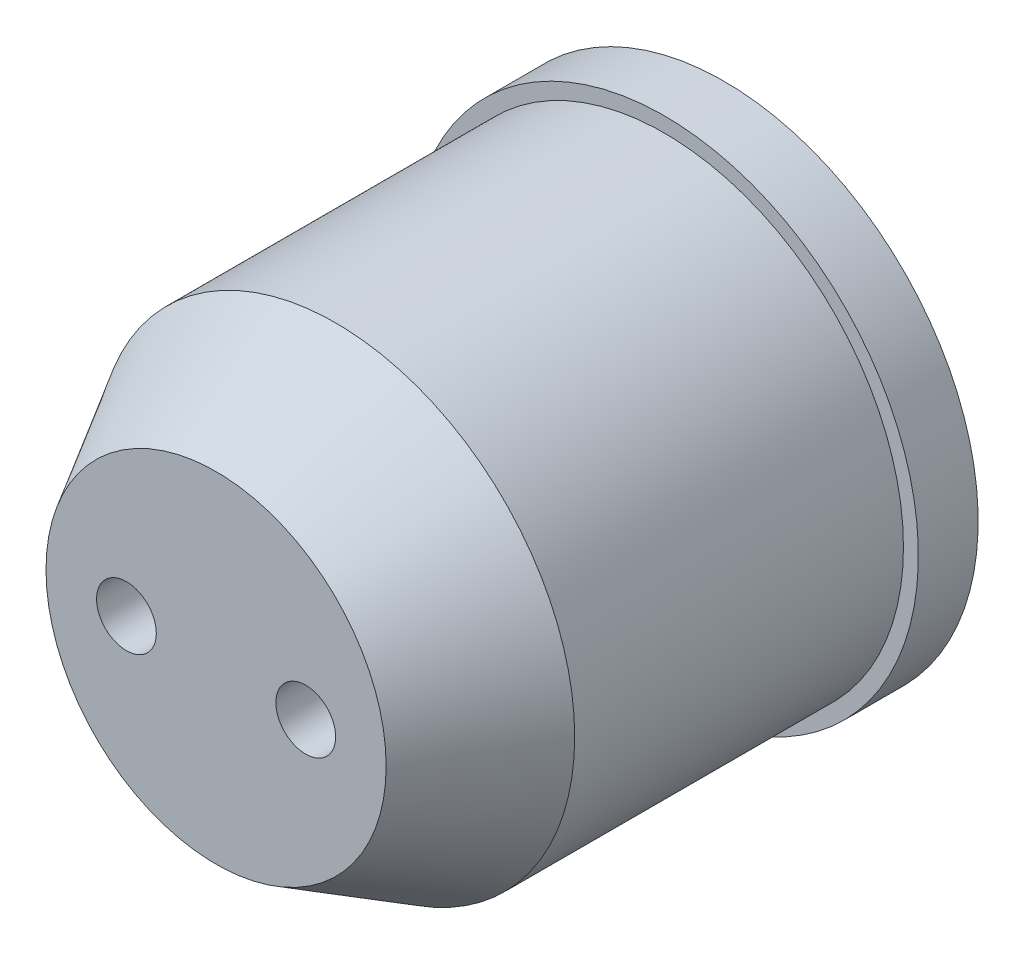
ISO-10303-21;
HEADER;
FILE_DESCRIPTION(('STEP AP214'),'2;1');
FILE_NAME('part.step','',(''),(''),'','','');
FILE_SCHEMA(('AUTOMOTIVE_DESIGN { 1 0 10303 214 1 1 1 1 }'));
ENDSEC;
DATA;
#1=APPLICATION_CONTEXT('core data for automotive mechanical design processes');
#2=APPLICATION_PROTOCOL_DEFINITION('international standard','automotive_design',2000,#1);
#3=PRODUCT_CONTEXT('',#1,'mechanical');
#4=PRODUCT('Part','Part','',(#3));
#5=PRODUCT_RELATED_PRODUCT_CATEGORY('part','',(#4));
#6=PRODUCT_DEFINITION_FORMATION('','',#4);
#7=PRODUCT_DEFINITION_CONTEXT('part definition',#1,'design');
#8=PRODUCT_DEFINITION('design','',#6,#7);
#9=PRODUCT_DEFINITION_SHAPE('','',#8);
#10=(LENGTH_UNIT() NAMED_UNIT(*) SI_UNIT(.MILLI.,.METRE.));
#11=(NAMED_UNIT(*) PLANE_ANGLE_UNIT() SI_UNIT($,.RADIAN.));
#12=(NAMED_UNIT(*) SI_UNIT($,.STERADIAN.) SOLID_ANGLE_UNIT());
#13=UNCERTAINTY_MEASURE_WITH_UNIT(LENGTH_MEASURE(1.E-05),#10,'distance_accuracy_value','');
#14=(GEOMETRIC_REPRESENTATION_CONTEXT(3) GLOBAL_UNCERTAINTY_ASSIGNED_CONTEXT((#13)) GLOBAL_UNIT_ASSIGNED_CONTEXT((#10,
#11,#12)) REPRESENTATION_CONTEXT('',''));
#15=CARTESIAN_POINT('',(0.,0.,0.));
#16=DIRECTION('',(0.,0.,1.));
#17=DIRECTION('',(1.,0.,0.));
#18=AXIS2_PLACEMENT_3D('',#15,#16,#17);
#19=CARTESIAN_POINT('',(0.,0.,7.5));
#20=DIRECTION('',(0.,0.,-1.));
#21=DIRECTION('',(-1.,0.,0.));
#22=AXIS2_PLACEMENT_3D('',#19,#20,#21);
#23=CYLINDRICAL_SURFACE('',#22,4.);
#24=CARTESIAN_POINT('',(0.,0.,5.49999999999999));
#25=DIRECTION('',(0.,0.,1.));
#26=DIRECTION('',(1.,0.,0.));
#27=AXIS2_PLACEMENT_3D('',#24,#25,#26);
#28=CIRCLE('',#27,4.);
#29=CARTESIAN_POINT('',(4.,0.,5.49999999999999));
#30=VERTEX_POINT('',#29);
#31=EDGE_CURVE('E10',#30,#30,#28,.F.);
#32=ORIENTED_EDGE('',*,*,#31,.T.);
#33=EDGE_LOOP('',(#32));
#34=FACE_BOUND('',#33,.T.);
#35=CARTESIAN_POINT('',(0.,0.,0.));
#36=DIRECTION('',(0.,0.,-1.));
#37=DIRECTION('',(-1.,0.,0.));
#38=AXIS2_PLACEMENT_3D('',#35,#36,#37);
#39=CIRCLE('',#38,4.);
#40=CARTESIAN_POINT('',(-4.,0.,0.));
#41=VERTEX_POINT('',#40);
#42=EDGE_CURVE('E67',#41,#41,#39,.T.);
#43=ORIENTED_EDGE('',*,*,#42,.F.);
#44=EDGE_LOOP('',(#43));
#45=FACE_BOUND('',#44,.T.);
#46=ADVANCED_FACE('F37',(#34,#45),#23,.T.);
#47=CARTESIAN_POINT('',(0.,0.,7.5));
#48=DIRECTION('',(0.,0.,1.));
#49=DIRECTION('',(1.,0.,0.));
#50=AXIS2_PLACEMENT_3D('',#47,#48,#49);
#51=PLANE('',#50);
#52=CARTESIAN_POINT('',(-1.5,0.,7.5));
#53=DIRECTION('',(0.,0.,1.));
#54=DIRECTION('',(1.,0.,0.));
#55=AXIS2_PLACEMENT_3D('',#52,#53,#54);
#56=CIRCLE('',#55,0.5);
#57=CARTESIAN_POINT('',(-1.,0.,7.5));
#58=VERTEX_POINT('',#57);
#59=EDGE_CURVE('E63',#58,#58,#56,.T.);
#60=ORIENTED_EDGE('',*,*,#59,.F.);
#61=EDGE_LOOP('',(#60));
#62=FACE_BOUND('',#61,.T.);
#63=CARTESIAN_POINT('',(1.5,0.,7.5));
#64=DIRECTION('',(0.,0.,1.));
#65=DIRECTION('',(1.,0.,0.));
#66=AXIS2_PLACEMENT_3D('',#63,#64,#65);
#67=CIRCLE('',#66,0.5);
#68=CARTESIAN_POINT('',(2.,0.,7.5));
#69=VERTEX_POINT('',#68);
#70=EDGE_CURVE('E54',#69,#69,#67,.T.);
#71=ORIENTED_EDGE('',*,*,#70,.F.);
#72=EDGE_LOOP('',(#71));
#73=FACE_BOUND('',#72,.T.);
#74=CARTESIAN_POINT('',(0.,0.,7.5));
#75=DIRECTION('',(0.,0.,1.));
#76=DIRECTION('',(1.,0.,0.));
#77=AXIS2_PLACEMENT_3D('',#74,#75,#76);
#78=CIRCLE('',#77,2.84529946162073);
#79=CARTESIAN_POINT('',(2.84529946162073,0.,7.5));
#80=VERTEX_POINT('',#79);
#81=EDGE_CURVE('E44',#80,#80,#78,.T.);
#82=ORIENTED_EDGE('',*,*,#81,.T.);
#83=EDGE_LOOP('',(#82));
#84=FACE_BOUND('',#83,.T.);
#85=ADVANCED_FACE('F102',(#62,#73,#84),#51,.T.);
#86=CARTESIAN_POINT('',(0.,0.,7.5));
#87=DIRECTION('',(0.,0.,-1.));
#88=DIRECTION('',(-1.,0.,0.));
#89=AXIS2_PLACEMENT_3D('',#86,#87,#88);
#90=CONICAL_SURFACE('',#89,2.84529946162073,0.523598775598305);
#91=ORIENTED_EDGE('',*,*,#31,.F.);
#92=EDGE_LOOP('',(#91));
#93=FACE_BOUND('',#92,.T.);
#94=ORIENTED_EDGE('',*,*,#81,.F.);
#95=EDGE_LOOP('',(#94));
#96=FACE_BOUND('',#95,.T.);
#97=ADVANCED_FACE('F106',(#93,#96),#90,.T.);
#98=CARTESIAN_POINT('',(0.,0.,5.));
#99=DIRECTION('',(0.,0.,-1.));
#100=DIRECTION('',(-1.,0.,0.));
#101=AXIS2_PLACEMENT_3D('',#98,#99,#100);
#102=CYLINDRICAL_SURFACE('',#101,2.5);
#103=CARTESIAN_POINT('',(0.,0.,5.));
#104=DIRECTION('',(0.,0.,-1.));
#105=DIRECTION('',(-1.,0.,0.));
#106=AXIS2_PLACEMENT_3D('',#103,#104,#105);
#107=CIRCLE('',#106,2.5);
#108=CARTESIAN_POINT('',(-2.5,0.,5.));
#109=VERTEX_POINT('',#108);
#110=EDGE_CURVE('E49',#109,#109,#107,.T.);
#111=ORIENTED_EDGE('',*,*,#110,.F.);
#112=EDGE_LOOP('',(#111));
#113=FACE_BOUND('',#112,.T.);
#114=CARTESIAN_POINT('',(0.,0.,-1.));
#115=DIRECTION('',(0.,0.,-1.));
#116=DIRECTION('',(-1.,0.,0.));
#117=AXIS2_PLACEMENT_3D('',#114,#115,#116);
#118=CIRCLE('',#117,2.5);
#119=CARTESIAN_POINT('',(-2.5,0.,-1.));
#120=VERTEX_POINT('',#119);
#121=EDGE_CURVE('E76',#120,#120,#118,.T.);
#122=ORIENTED_EDGE('',*,*,#121,.T.);
#123=EDGE_LOOP('',(#122));
#124=FACE_BOUND('',#123,.T.);
#125=ADVANCED_FACE('F80',(#113,#124),#102,.F.);
#126=CARTESIAN_POINT('',(0.,0.,5.));
#127=DIRECTION('',(0.,0.,-1.));
#128=DIRECTION('',(-1.,0.,0.));
#129=AXIS2_PLACEMENT_3D('',#126,#127,#128);
#130=PLANE('',#129);
#131=CARTESIAN_POINT('',(-1.5,0.,5.));
#132=DIRECTION('',(0.,0.,-1.));
#133=DIRECTION('',(-1.,0.,0.));
#134=AXIS2_PLACEMENT_3D('',#131,#132,#133);
#135=CIRCLE('',#134,0.5);
#136=CARTESIAN_POINT('',(-2.,0.,5.));
#137=VERTEX_POINT('',#136);
#138=EDGE_CURVE('E40',#137,#137,#135,.T.);
#139=ORIENTED_EDGE('',*,*,#138,.F.);
#140=EDGE_LOOP('',(#139));
#141=FACE_BOUND('',#140,.T.);
#142=CARTESIAN_POINT('',(1.5,0.,5.));
#143=DIRECTION('',(0.,0.,-1.));
#144=DIRECTION('',(-1.,0.,0.));
#145=AXIS2_PLACEMENT_3D('',#142,#143,#144);
#146=CIRCLE('',#145,0.5);
#147=CARTESIAN_POINT('',(1.,0.,5.));
#148=VERTEX_POINT('',#147);
#149=EDGE_CURVE('E52',#148,#148,#146,.T.);
#150=ORIENTED_EDGE('',*,*,#149,.F.);
#151=EDGE_LOOP('',(#150));
#152=FACE_BOUND('',#151,.T.);
#153=ORIENTED_EDGE('',*,*,#110,.T.);
#154=EDGE_LOOP('',(#153));
#155=FACE_BOUND('',#154,.T.);
#156=ADVANCED_FACE('F118',(#141,#152,#155),#130,.T.);
#157=CARTESIAN_POINT('',(1.5,0.,0.));
#158=DIRECTION('',(0.,0.,1.));
#159=DIRECTION('',(1.,0.,0.));
#160=AXIS2_PLACEMENT_3D('',#157,#158,#159);
#161=CYLINDRICAL_SURFACE('',#160,0.5);
#162=ORIENTED_EDGE('',*,*,#149,.T.);
#163=EDGE_LOOP('',(#162));
#164=FACE_BOUND('',#163,.T.);
#165=ORIENTED_EDGE('',*,*,#70,.T.);
#166=EDGE_LOOP('',(#165));
#167=FACE_BOUND('',#166,.T.);
#168=ADVANCED_FACE('F122',(#164,#167),#161,.F.);
#169=CARTESIAN_POINT('',(-1.5,0.,0.));
#170=DIRECTION('',(0.,0.,1.));
#171=DIRECTION('',(1.,0.,0.));
#172=AXIS2_PLACEMENT_3D('',#169,#170,#171);
#173=CYLINDRICAL_SURFACE('',#172,0.5);
#174=ORIENTED_EDGE('',*,*,#138,.T.);
#175=EDGE_LOOP('',(#174));
#176=FACE_BOUND('',#175,.T.);
#177=ORIENTED_EDGE('',*,*,#59,.T.);
#178=EDGE_LOOP('',(#177));
#179=FACE_BOUND('',#178,.T.);
#180=ADVANCED_FACE('F97',(#176,#179),#173,.F.);
#181=CARTESIAN_POINT('',(0.,0.,0.));
#182=DIRECTION('',(0.,0.,-1.));
#183=DIRECTION('',(-1.,0.,0.));
#184=AXIS2_PLACEMENT_3D('',#181,#182,#183);
#185=PLANE('',#184);
#186=CARTESIAN_POINT('',(0.,0.,0.));
#187=DIRECTION('',(0.,0.,-1.));
#188=DIRECTION('',(-1.,0.,0.));
#189=AXIS2_PLACEMENT_3D('',#186,#187,#188);
#190=CIRCLE('',#189,4.25);
#191=CARTESIAN_POINT('',(-4.25,0.,0.));
#192=VERTEX_POINT('',#191);
#193=EDGE_CURVE('E73',#192,#192,#190,.T.);
#194=ORIENTED_EDGE('',*,*,#193,.F.);
#195=EDGE_LOOP('',(#194));
#196=FACE_BOUND('',#195,.T.);
#197=ORIENTED_EDGE('',*,*,#42,.T.);
#198=EDGE_LOOP('',(#197));
#199=FACE_BOUND('',#198,.T.);
#200=ADVANCED_FACE('F91',(#196,#199),#185,.F.);
#201=CARTESIAN_POINT('',(0.,0.,-1.));
#202=DIRECTION('',(0.,0.,1.));
#203=DIRECTION('',(1.,0.,0.));
#204=AXIS2_PLACEMENT_3D('',#201,#202,#203);
#205=CYLINDRICAL_SURFACE('',#204,4.25);
#206=CARTESIAN_POINT('',(0.,0.,-1.));
#207=DIRECTION('',(0.,0.,-1.));
#208=DIRECTION('',(-1.,0.,0.));
#209=AXIS2_PLACEMENT_3D('',#206,#207,#208);
#210=CIRCLE('',#209,4.25);
#211=CARTESIAN_POINT('',(-4.25,0.,-1.));
#212=VERTEX_POINT('',#211);
#213=EDGE_CURVE('E70',#212,#212,#210,.T.);
#214=ORIENTED_EDGE('',*,*,#213,.F.);
#215=EDGE_LOOP('',(#214));
#216=FACE_BOUND('',#215,.T.);
#217=ORIENTED_EDGE('',*,*,#193,.T.);
#218=EDGE_LOOP('',(#217));
#219=FACE_BOUND('',#218,.T.);
#220=ADVANCED_FACE('F85',(#216,#219),#205,.T.);
#221=CARTESIAN_POINT('',(0.,0.,-1.));
#222=DIRECTION('',(0.,0.,-1.));
#223=DIRECTION('',(-1.,0.,0.));
#224=AXIS2_PLACEMENT_3D('',#221,#222,#223);
#225=PLANE('',#224);
#226=ORIENTED_EDGE('',*,*,#121,.F.);
#227=EDGE_LOOP('',(#226));
#228=FACE_BOUND('',#227,.T.);
#229=ORIENTED_EDGE('',*,*,#213,.T.);
#230=EDGE_LOOP('',(#229));
#231=FACE_BOUND('',#230,.T.);
#232=ADVANCED_FACE('F82',(#228,#231),#225,.T.);
#233=CLOSED_SHELL('',(#46,#85,#97,#125,#156,#168,#180,#200,#220,#232));
#234=MANIFOLD_SOLID_BREP('B2',#233);
#235=ADVANCED_BREP_SHAPE_REPRESENTATION('',(#18,#234),#14);
#236=SHAPE_DEFINITION_REPRESENTATION(#9,#235);
ENDSEC;
END-ISO-10303-21;
